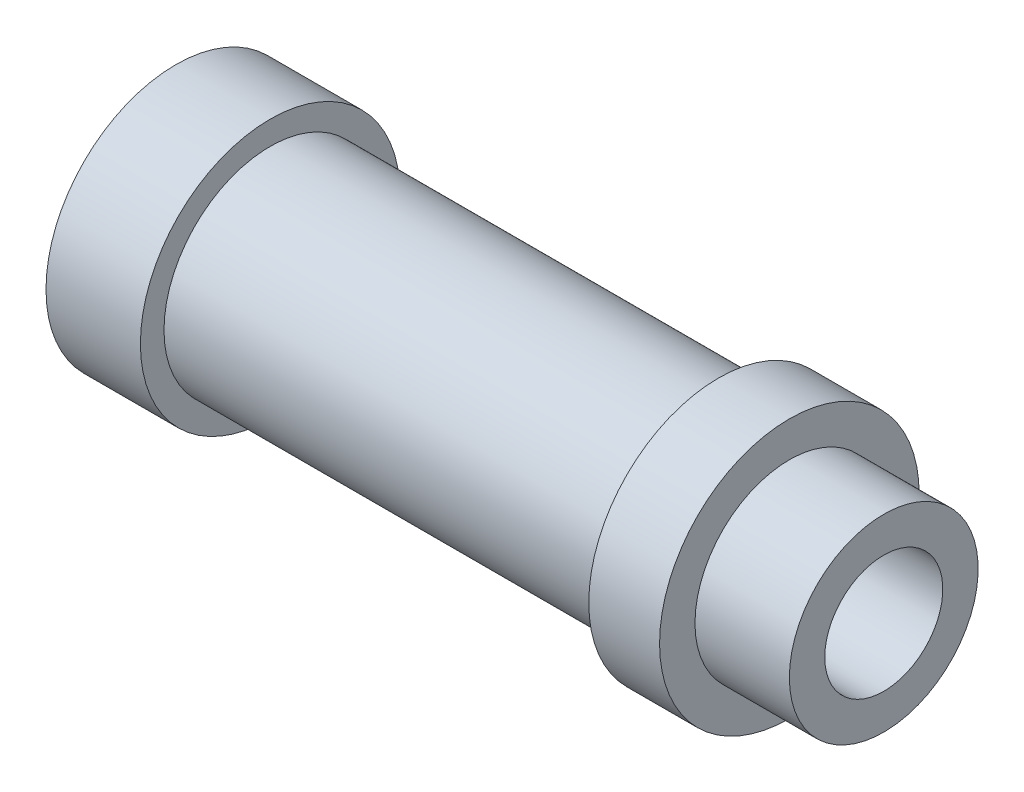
from build123d import *


with BuildPart() as part:
    # Sketch1 → Revolve1 (revolve)
    with BuildSketch(Plane.XY, mode=Mode.PRIVATE) as revolve1_sk:
        Polygon((0, 2.75), (0, 2), (2.308262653, 1.25), (15, 1.25), (15, 2), (13, 2), (13, 2.75), (11.5, 2.75), (11.5, 2.25), (2, 2.25), (2, 2.75), align=None)
    revolve(revolve1_sk.sketch.rotate(Axis((-6.059960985, 0, 0), (1, 0, 0)), 90), axis=Axis((-6.059960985, 0, 0), (1, 0, 0)))


solid = part.part
